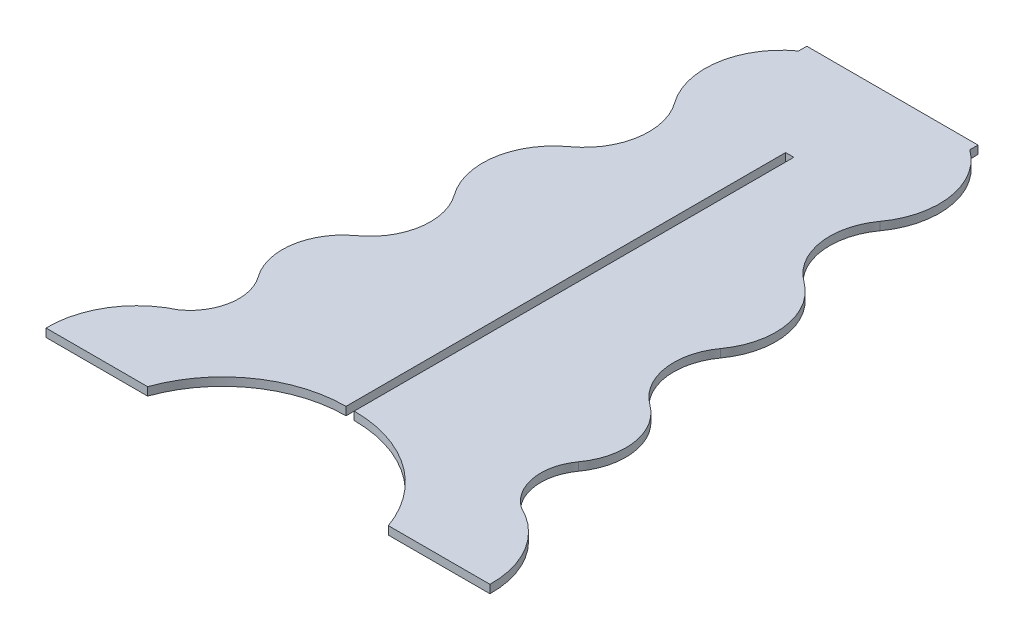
ISO-10303-21;
HEADER;
FILE_DESCRIPTION(('STEP AP214'),'2;1');
FILE_NAME('part.step','',(''),(''),'','','');
FILE_SCHEMA(('AUTOMOTIVE_DESIGN { 1 0 10303 214 1 1 1 1 }'));
ENDSEC;
DATA;
#1=APPLICATION_CONTEXT('core data for automotive mechanical design processes');
#2=APPLICATION_PROTOCOL_DEFINITION('international standard','automotive_design',2000,#1);
#3=PRODUCT_CONTEXT('',#1,'mechanical');
#4=PRODUCT('Part','Part','',(#3));
#5=PRODUCT_RELATED_PRODUCT_CATEGORY('part','',(#4));
#6=PRODUCT_DEFINITION_FORMATION('','',#4);
#7=PRODUCT_DEFINITION_CONTEXT('part definition',#1,'design');
#8=PRODUCT_DEFINITION('design','',#6,#7);
#9=PRODUCT_DEFINITION_SHAPE('','',#8);
#10=(LENGTH_UNIT() NAMED_UNIT(*) SI_UNIT(.MILLI.,.METRE.));
#11=(NAMED_UNIT(*) PLANE_ANGLE_UNIT() SI_UNIT($,.RADIAN.));
#12=(NAMED_UNIT(*) SI_UNIT($,.STERADIAN.) SOLID_ANGLE_UNIT());
#13=UNCERTAINTY_MEASURE_WITH_UNIT(LENGTH_MEASURE(1.E-05),#10,'distance_accuracy_value','');
#14=(GEOMETRIC_REPRESENTATION_CONTEXT(3) GLOBAL_UNCERTAINTY_ASSIGNED_CONTEXT((#13)) GLOBAL_UNIT_ASSIGNED_CONTEXT((#10,
#11,#12)) REPRESENTATION_CONTEXT('',''));
#15=CARTESIAN_POINT('',(0.,0.,0.));
#16=DIRECTION('',(0.,0.,1.));
#17=DIRECTION('',(1.,0.,0.));
#18=AXIS2_PLACEMENT_3D('',#15,#16,#17);
#19=CARTESIAN_POINT('',(193.997589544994,12.,117.55850333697));
#20=DIRECTION('',(0.,-1.,0.));
#21=DIRECTION('',(0.,0.,-1.));
#22=AXIS2_PLACEMENT_3D('',#19,#20,#21);
#23=CYLINDRICAL_SURFACE('',#22,130.21624969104);
#24=CARTESIAN_POINT('',(193.997589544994,0.,117.55850333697));
#25=DIRECTION('',(0.,1.,0.));
#26=DIRECTION('',(0.,0.,-1.));
#27=AXIS2_PLACEMENT_3D('',#24,#25,#26);
#28=CIRCLE('',#27,130.21624969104);
#29=CARTESIAN_POINT('',(324.190948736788,0.,120.));
#30=VERTEX_POINT('',#29);
#31=CARTESIAN_POINT('',(250.,0.,0.));
#32=VERTEX_POINT('',#31);
#33=EDGE_CURVE('E225',#30,#32,#28,.T.);
#34=ORIENTED_EDGE('',*,*,#33,.T.);
#35=DIRECTION('',(0.,-1.,0.));
#36=VECTOR('',#35,1.);
#37=CARTESIAN_POINT('',(250.,12.,0.));
#38=LINE('',#37,#36);
#39=CARTESIAN_POINT('',(250.,12.,0.));
#40=VERTEX_POINT('',#39);
#41=EDGE_CURVE('E11',#40,#32,#38,.T.);
#42=ORIENTED_EDGE('',*,*,#41,.F.);
#43=CARTESIAN_POINT('',(193.997589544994,12.,117.55850333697));
#44=DIRECTION('',(0.,1.,0.));
#45=DIRECTION('',(0.,0.,-1.));
#46=AXIS2_PLACEMENT_3D('',#43,#44,#45);
#47=CIRCLE('',#46,130.21624969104);
#48=CARTESIAN_POINT('',(324.190948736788,12.,120.));
#49=VERTEX_POINT('',#48);
#50=EDGE_CURVE('E271',#49,#40,#47,.T.);
#51=ORIENTED_EDGE('',*,*,#50,.F.);
#52=DIRECTION('',(0.,-1.,0.));
#53=VECTOR('',#52,1.);
#54=CARTESIAN_POINT('',(324.190948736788,12.,120.));
#55=LINE('',#54,#53);
#56=EDGE_CURVE('E221',#49,#30,#55,.T.);
#57=ORIENTED_EDGE('',*,*,#56,.T.);
#58=EDGE_LOOP('',(#34,#42,#51,#57));
#59=FACE_BOUND('',#58,.T.);
#60=ADVANCED_FACE('F33',(#59),#23,.T.);
#61=CARTESIAN_POINT('',(291.917635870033,12.,-57.9167335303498));
#62=DIRECTION('',(0.,-1.,0.));
#63=DIRECTION('',(0.,0.,-1.));
#64=AXIS2_PLACEMENT_3D('',#61,#62,#63);
#65=CYLINDRICAL_SURFACE('',#64,71.4943090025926);
#66=CARTESIAN_POINT('',(291.917635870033,0.,-57.9167335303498));
#67=DIRECTION('',(0.,-1.,0.));
#68=DIRECTION('',(0.,0.,1.));
#69=AXIS2_PLACEMENT_3D('',#66,#67,#68);
#70=CIRCLE('',#69,71.4943090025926);
#71=CARTESIAN_POINT('',(234.000902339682,0.,-99.8343694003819));
#72=VERTEX_POINT('',#71);
#73=EDGE_CURVE('E228',#32,#72,#70,.T.);
#74=ORIENTED_EDGE('',*,*,#73,.T.);
#75=DIRECTION('',(0.,-1.,0.));
#76=VECTOR('',#75,1.);
#77=CARTESIAN_POINT('',(234.000902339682,12.,-99.8343694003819));
#78=LINE('',#77,#76);
#79=CARTESIAN_POINT('',(234.000902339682,12.,-99.8343694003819));
#80=VERTEX_POINT('',#79);
#81=EDGE_CURVE('E41',#80,#72,#78,.T.);
#82=ORIENTED_EDGE('',*,*,#81,.F.);
#83=CARTESIAN_POINT('',(291.917635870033,12.,-57.9167335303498));
#84=DIRECTION('',(0.,-1.,0.));
#85=DIRECTION('',(0.,0.,1.));
#86=AXIS2_PLACEMENT_3D('',#83,#84,#85);
#87=CIRCLE('',#86,71.4943090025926);
#88=EDGE_CURVE('E140',#40,#80,#87,.T.);
#89=ORIENTED_EDGE('',*,*,#88,.F.);
#90=ORIENTED_EDGE('',*,*,#41,.T.);
#91=EDGE_LOOP('',(#74,#82,#89,#90));
#92=FACE_BOUND('',#91,.T.);
#93=ADVANCED_FACE('F409',(#92),#65,.F.);
#94=CARTESIAN_POINT('',(162.178085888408,12.,-151.816628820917));
#95=DIRECTION('',(0.,-1.,0.));
#96=DIRECTION('',(0.,0.,-1.));
#97=AXIS2_PLACEMENT_3D('',#94,#95,#96);
#98=CYLINDRICAL_SURFACE('',#97,88.6604323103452);
#99=CARTESIAN_POINT('',(162.178085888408,0.,-151.816628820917));
#100=DIRECTION('',(0.,1.,0.));
#101=DIRECTION('',(0.,0.,-1.));
#102=AXIS2_PLACEMENT_3D('',#99,#100,#101);
#103=CIRCLE('',#102,88.6604323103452);
#104=CARTESIAN_POINT('',(214.160345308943,0.,-223.639445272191));
#105=VERTEX_POINT('',#104);
#106=EDGE_CURVE('E230',#72,#105,#103,.T.);
#107=ORIENTED_EDGE('',*,*,#106,.T.);
#108=DIRECTION('',(0.,-1.,0.));
#109=VECTOR('',#108,1.);
#110=CARTESIAN_POINT('',(214.160345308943,12.,-223.639445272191));
#111=LINE('',#110,#109);
#112=CARTESIAN_POINT('',(214.160345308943,12.,-223.639445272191));
#113=VERTEX_POINT('',#112);
#114=EDGE_CURVE('E326',#113,#105,#111,.T.);
#115=ORIENTED_EDGE('',*,*,#114,.F.);
#116=CARTESIAN_POINT('',(162.178085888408,12.,-151.816628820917));
#117=DIRECTION('',(0.,1.,0.));
#118=DIRECTION('',(0.,0.,-1.));
#119=AXIS2_PLACEMENT_3D('',#116,#117,#118);
#120=CIRCLE('',#119,88.6604323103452);
#121=EDGE_CURVE('E334',#80,#113,#120,.T.);
#122=ORIENTED_EDGE('',*,*,#121,.F.);
#123=ORIENTED_EDGE('',*,*,#81,.T.);
#124=EDGE_LOOP('',(#107,#115,#122,#123));
#125=FACE_BOUND('',#124,.T.);
#126=ADVANCED_FACE('F332',(#125),#98,.T.);
#127=CARTESIAN_POINT('',(265.82579663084,12.,-295.024534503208));
#128=DIRECTION('',(0.,-1.,0.));
#129=DIRECTION('',(0.,0.,-1.));
#130=AXIS2_PLACEMENT_3D('',#127,#128,#129);
#131=CYLINDRICAL_SURFACE('',#130,88.1200875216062);
#132=CARTESIAN_POINT('',(265.82579663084,0.,-295.024534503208));
#133=DIRECTION('',(0.,-1.,0.));
#134=DIRECTION('',(0.,0.,1.));
#135=AXIS2_PLACEMENT_3D('',#132,#133,#134);
#136=CIRCLE('',#135,88.1200875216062);
#137=CARTESIAN_POINT('',(194.440707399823,0.,-346.689985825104));
#138=VERTEX_POINT('',#137);
#139=EDGE_CURVE('E232',#105,#138,#136,.T.);
#140=ORIENTED_EDGE('',*,*,#139,.T.);
#141=DIRECTION('',(0.,-1.,0.));
#142=VECTOR('',#141,1.);
#143=CARTESIAN_POINT('',(194.440707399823,12.,-346.689985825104));
#144=LINE('',#143,#142);
#145=CARTESIAN_POINT('',(194.440707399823,12.,-346.689985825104));
#146=VERTEX_POINT('',#145);
#147=EDGE_CURVE('E323',#146,#138,#144,.T.);
#148=ORIENTED_EDGE('',*,*,#147,.F.);
#149=CARTESIAN_POINT('',(265.82579663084,12.,-295.024534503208));
#150=DIRECTION('',(0.,-1.,0.));
#151=DIRECTION('',(0.,0.,1.));
#152=AXIS2_PLACEMENT_3D('',#149,#150,#151);
#153=CIRCLE('',#152,88.1200875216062);
#154=EDGE_CURVE('E352',#113,#146,#153,.T.);
#155=ORIENTED_EDGE('',*,*,#154,.F.);
#156=ORIENTED_EDGE('',*,*,#114,.T.);
#157=EDGE_LOOP('',(#140,#148,#155,#156));
#158=FACE_BOUND('',#157,.T.);
#159=ADVANCED_FACE('F343',(#158),#131,.F.);
#160=CARTESIAN_POINT('',(110.324289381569,12.,-407.569824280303));
#161=DIRECTION('',(0.,-1.,0.));
#162=DIRECTION('',(0.,0.,-1.));
#163=AXIS2_PLACEMENT_3D('',#160,#161,#162);
#164=CYLINDRICAL_SURFACE('',#163,103.836055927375);
#165=CARTESIAN_POINT('',(110.324289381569,0.,-407.569824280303));
#166=DIRECTION('',(0.,1.,0.));
#167=DIRECTION('',(0.,0.,-1.));
#168=AXIS2_PLACEMENT_3D('',#165,#166,#167);
#169=CIRCLE('',#168,103.836055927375);
#170=CARTESIAN_POINT('',(171.20412783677,0.,-491.686242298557));
#171=VERTEX_POINT('',#170);
#172=EDGE_CURVE('E234',#138,#171,#169,.T.);
#173=ORIENTED_EDGE('',*,*,#172,.T.);
#174=DIRECTION('',(0.,-1.,0.));
#175=VECTOR('',#174,1.);
#176=CARTESIAN_POINT('',(171.20412783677,12.,-491.686242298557));
#177=LINE('',#176,#175);
#178=CARTESIAN_POINT('',(171.20412783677,12.,-491.686242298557));
#179=VERTEX_POINT('',#178);
#180=EDGE_CURVE('E320',#179,#171,#177,.T.);
#181=ORIENTED_EDGE('',*,*,#180,.F.);
#182=CARTESIAN_POINT('',(110.324289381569,12.,-407.569824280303));
#183=DIRECTION('',(0.,1.,0.));
#184=DIRECTION('',(0.,0.,-1.));
#185=AXIS2_PLACEMENT_3D('',#182,#183,#184);
#186=CIRCLE('',#185,103.836055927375);
#187=EDGE_CURVE('E349',#146,#179,#186,.T.);
#188=ORIENTED_EDGE('',*,*,#187,.F.);
#189=ORIENTED_EDGE('',*,*,#147,.T.);
#190=EDGE_LOOP('',(#173,#181,#188,#189));
#191=FACE_BOUND('',#190,.T.);
#192=ADVANCED_FACE('F347',(#191),#164,.T.);
#193=CARTESIAN_POINT('',(226.775992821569,12.,-568.468742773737));
#194=DIRECTION('',(0.,-1.,0.));
#195=DIRECTION('',(0.,0.,-1.));
#196=AXIS2_PLACEMENT_3D('',#193,#194,#195);
#197=CYLINDRICAL_SURFACE('',#196,94.7828283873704);
#198=CARTESIAN_POINT('',(226.775992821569,0.,-568.468742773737));
#199=DIRECTION('',(0.,-1.,0.));
#200=DIRECTION('',(0.,0.,1.));
#201=AXIS2_PLACEMENT_3D('',#198,#199,#200);
#202=CIRCLE('',#201,94.7828283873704);
#203=CARTESIAN_POINT('',(149.993492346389,0.,-624.040607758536));
#204=VERTEX_POINT('',#203);
#205=EDGE_CURVE('E236',#171,#204,#202,.T.);
#206=ORIENTED_EDGE('',*,*,#205,.T.);
#207=DIRECTION('',(0.,-1.,0.));
#208=VECTOR('',#207,1.);
#209=CARTESIAN_POINT('',(149.993492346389,12.,-624.040607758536));
#210=LINE('',#209,#208);
#211=CARTESIAN_POINT('',(149.993492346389,12.,-624.040607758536));
#212=VERTEX_POINT('',#211);
#213=EDGE_CURVE('E317',#212,#204,#210,.T.);
#214=ORIENTED_EDGE('',*,*,#213,.F.);
#215=CARTESIAN_POINT('',(226.775992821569,12.,-568.468742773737));
#216=DIRECTION('',(0.,-1.,0.));
#217=DIRECTION('',(0.,0.,1.));
#218=AXIS2_PLACEMENT_3D('',#215,#216,#217);
#219=CIRCLE('',#218,94.7828283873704);
#220=EDGE_CURVE('E351',#179,#212,#219,.T.);
#221=ORIENTED_EDGE('',*,*,#220,.F.);
#222=ORIENTED_EDGE('',*,*,#180,.T.);
#223=EDGE_LOOP('',(#206,#214,#221,#222));
#224=FACE_BOUND('',#223,.T.);
#225=ADVANCED_FACE('F422',(#224),#197,.F.);
#226=CARTESIAN_POINT('',(59.5170500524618,12.,-689.523557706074));
#227=DIRECTION('',(0.,-1.,0.));
#228=DIRECTION('',(0.,0.,-1.));
#229=AXIS2_PLACEMENT_3D('',#226,#227,#228);
#230=CYLINDRICAL_SURFACE('',#229,111.687077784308);
#231=CARTESIAN_POINT('',(59.5170500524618,0.,-689.523557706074));
#232=DIRECTION('',(0.,1.,0.));
#233=DIRECTION('',(0.,0.,-1.));
#234=AXIS2_PLACEMENT_3D('',#231,#232,#233);
#235=CIRCLE('',#234,111.687077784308);
#236=CARTESIAN_POINT('',(125.,0.,-780.));
#237=VERTEX_POINT('',#236);
#238=EDGE_CURVE('E238',#204,#237,#235,.T.);
#239=ORIENTED_EDGE('',*,*,#238,.T.);
#240=DIRECTION('',(0.,-1.,0.));
#241=VECTOR('',#240,1.);
#242=CARTESIAN_POINT('',(125.,12.,-780.));
#243=LINE('',#242,#241);
#244=CARTESIAN_POINT('',(125.,12.,-780.));
#245=VERTEX_POINT('',#244);
#246=EDGE_CURVE('E314',#245,#237,#243,.T.);
#247=ORIENTED_EDGE('',*,*,#246,.F.);
#248=CARTESIAN_POINT('',(59.5170500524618,12.,-689.523557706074));
#249=DIRECTION('',(0.,1.,0.));
#250=DIRECTION('',(0.,0.,-1.));
#251=AXIS2_PLACEMENT_3D('',#248,#249,#250);
#252=CIRCLE('',#251,111.687077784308);
#253=EDGE_CURVE('E354',#212,#245,#252,.T.);
#254=ORIENTED_EDGE('',*,*,#253,.F.);
#255=ORIENTED_EDGE('',*,*,#213,.T.);
#256=EDGE_LOOP('',(#239,#247,#254,#255));
#257=FACE_BOUND('',#256,.T.);
#258=ADVANCED_FACE('F425',(#257),#230,.T.);
#259=CARTESIAN_POINT('',(125.,12.,-780.));
#260=DIRECTION('',(-1.,0.,0.));
#261=DIRECTION('',(0.,0.,1.));
#262=AXIS2_PLACEMENT_3D('',#259,#260,#261);
#263=PLANE('',#262);
#264=DIRECTION('',(0.,0.,-1.));
#265=VECTOR('',#264,1.);
#266=CARTESIAN_POINT('',(125.,0.,-780.));
#267=LINE('',#266,#265);
#268=CARTESIAN_POINT('',(125.,0.,-792.));
#269=VERTEX_POINT('',#268);
#270=EDGE_CURVE('E240',#237,#269,#267,.T.);
#271=ORIENTED_EDGE('',*,*,#270,.T.);
#272=DIRECTION('',(0.,-1.,0.));
#273=VECTOR('',#272,1.);
#274=CARTESIAN_POINT('',(125.,12.,-792.));
#275=LINE('',#274,#273);
#276=CARTESIAN_POINT('',(125.,12.,-792.));
#277=VERTEX_POINT('',#276);
#278=EDGE_CURVE('E311',#277,#269,#275,.T.);
#279=ORIENTED_EDGE('',*,*,#278,.F.);
#280=DIRECTION('',(0.,0.,-1.));
#281=VECTOR('',#280,1.);
#282=CARTESIAN_POINT('',(125.,12.,-780.));
#283=LINE('',#282,#281);
#284=EDGE_CURVE('E360',#245,#277,#283,.T.);
#285=ORIENTED_EDGE('',*,*,#284,.F.);
#286=ORIENTED_EDGE('',*,*,#246,.T.);
#287=EDGE_LOOP('',(#271,#279,#285,#286));
#288=FACE_BOUND('',#287,.T.);
#289=ADVANCED_FACE('F429',(#288),#263,.F.);
#290=CARTESIAN_POINT('',(125.,12.,-792.));
#291=DIRECTION('',(0.,0.,1.));
#292=DIRECTION('',(1.,0.,0.));
#293=AXIS2_PLACEMENT_3D('',#290,#291,#292);
#294=PLANE('',#293);
#295=DIRECTION('',(-1.,0.,0.));
#296=VECTOR('',#295,1.);
#297=CARTESIAN_POINT('',(125.,0.,-792.));
#298=LINE('',#297,#296);
#299=CARTESIAN_POINT('',(-125.,0.,-792.));
#300=VERTEX_POINT('',#299);
#301=EDGE_CURVE('E242',#269,#300,#298,.T.);
#302=ORIENTED_EDGE('',*,*,#301,.T.);
#303=DIRECTION('',(0.,-1.,0.));
#304=VECTOR('',#303,1.);
#305=CARTESIAN_POINT('',(-125.,12.,-792.));
#306=LINE('',#305,#304);
#307=CARTESIAN_POINT('',(-125.,12.,-792.));
#308=VERTEX_POINT('',#307);
#309=EDGE_CURVE('E308',#308,#300,#306,.T.);
#310=ORIENTED_EDGE('',*,*,#309,.F.);
#311=DIRECTION('',(-1.,0.,0.));
#312=VECTOR('',#311,1.);
#313=CARTESIAN_POINT('',(125.,12.,-792.));
#314=LINE('',#313,#312);
#315=EDGE_CURVE('E362',#277,#308,#314,.T.);
#316=ORIENTED_EDGE('',*,*,#315,.F.);
#317=ORIENTED_EDGE('',*,*,#278,.T.);
#318=EDGE_LOOP('',(#302,#310,#316,#317));
#319=FACE_BOUND('',#318,.T.);
#320=ADVANCED_FACE('F433',(#319),#294,.F.);
#321=CARTESIAN_POINT('',(-125.,12.,-780.));
#322=DIRECTION('',(1.,0.,0.));
#323=DIRECTION('',(0.,0.,-1.));
#324=AXIS2_PLACEMENT_3D('',#321,#322,#323);
#325=PLANE('',#324);
#326=DIRECTION('',(0.,0.,1.));
#327=VECTOR('',#326,1.);
#328=CARTESIAN_POINT('',(-125.,0.,-780.));
#329=LINE('',#328,#327);
#330=CARTESIAN_POINT('',(-125.,0.,-780.));
#331=VERTEX_POINT('',#330);
#332=EDGE_CURVE('E244',#300,#331,#329,.T.);
#333=ORIENTED_EDGE('',*,*,#332,.T.);
#334=DIRECTION('',(0.,-1.,0.));
#335=VECTOR('',#334,1.);
#336=CARTESIAN_POINT('',(-125.,12.,-780.));
#337=LINE('',#336,#335);
#338=CARTESIAN_POINT('',(-125.,12.,-780.));
#339=VERTEX_POINT('',#338);
#340=EDGE_CURVE('E305',#339,#331,#337,.T.);
#341=ORIENTED_EDGE('',*,*,#340,.F.);
#342=DIRECTION('',(0.,0.,1.));
#343=VECTOR('',#342,1.);
#344=CARTESIAN_POINT('',(-125.,12.,-780.));
#345=LINE('',#344,#343);
#346=EDGE_CURVE('E364',#308,#339,#345,.T.);
#347=ORIENTED_EDGE('',*,*,#346,.F.);
#348=ORIENTED_EDGE('',*,*,#309,.T.);
#349=EDGE_LOOP('',(#333,#341,#347,#348));
#350=FACE_BOUND('',#349,.T.);
#351=ADVANCED_FACE('F437',(#350),#325,.F.);
#352=CARTESIAN_POINT('',(-59.5170500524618,12.,-689.523557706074));
#353=DIRECTION('',(0.,-1.,0.));
#354=DIRECTION('',(0.,0.,-1.));
#355=AXIS2_PLACEMENT_3D('',#352,#353,#354);
#356=CYLINDRICAL_SURFACE('',#355,111.687077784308);
#357=CARTESIAN_POINT('',(-59.5170500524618,0.,-689.523557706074));
#358=DIRECTION('',(0.,1.,0.));
#359=DIRECTION('',(0.,0.,1.));
#360=AXIS2_PLACEMENT_3D('',#357,#358,#359);
#361=CIRCLE('',#360,111.687077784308);
#362=CARTESIAN_POINT('',(-149.993492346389,0.,-624.040607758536));
#363=VERTEX_POINT('',#362);
#364=EDGE_CURVE('E246',#331,#363,#361,.T.);
#365=ORIENTED_EDGE('',*,*,#364,.T.);
#366=DIRECTION('',(0.,-1.,0.));
#367=VECTOR('',#366,1.);
#368=CARTESIAN_POINT('',(-149.993492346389,12.,-624.040607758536));
#369=LINE('',#368,#367);
#370=CARTESIAN_POINT('',(-149.993492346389,12.,-624.040607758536));
#371=VERTEX_POINT('',#370);
#372=EDGE_CURVE('E302',#371,#363,#369,.T.);
#373=ORIENTED_EDGE('',*,*,#372,.F.);
#374=CARTESIAN_POINT('',(-59.5170500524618,12.,-689.523557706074));
#375=DIRECTION('',(0.,1.,0.));
#376=DIRECTION('',(0.,0.,1.));
#377=AXIS2_PLACEMENT_3D('',#374,#375,#376);
#378=CIRCLE('',#377,111.687077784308);
#379=EDGE_CURVE('E366',#339,#371,#378,.T.);
#380=ORIENTED_EDGE('',*,*,#379,.F.);
#381=ORIENTED_EDGE('',*,*,#340,.T.);
#382=EDGE_LOOP('',(#365,#373,#380,#381));
#383=FACE_BOUND('',#382,.T.);
#384=ADVANCED_FACE('F441',(#383),#356,.T.);
#385=CARTESIAN_POINT('',(-226.775992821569,12.,-568.468742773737));
#386=DIRECTION('',(0.,-1.,0.));
#387=DIRECTION('',(0.,0.,-1.));
#388=AXIS2_PLACEMENT_3D('',#385,#386,#387);
#389=CYLINDRICAL_SURFACE('',#388,94.7828283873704);
#390=CARTESIAN_POINT('',(-226.775992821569,0.,-568.468742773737));
#391=DIRECTION('',(0.,-1.,0.));
#392=DIRECTION('',(0.,0.,-1.));
#393=AXIS2_PLACEMENT_3D('',#390,#391,#392);
#394=CIRCLE('',#393,94.7828283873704);
#395=CARTESIAN_POINT('',(-171.20412783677,0.,-491.686242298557));
#396=VERTEX_POINT('',#395);
#397=EDGE_CURVE('E248',#363,#396,#394,.T.);
#398=ORIENTED_EDGE('',*,*,#397,.T.);
#399=DIRECTION('',(0.,-1.,0.));
#400=VECTOR('',#399,1.);
#401=CARTESIAN_POINT('',(-171.20412783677,12.,-491.686242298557));
#402=LINE('',#401,#400);
#403=CARTESIAN_POINT('',(-171.20412783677,12.,-491.686242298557));
#404=VERTEX_POINT('',#403);
#405=EDGE_CURVE('E299',#404,#396,#402,.T.);
#406=ORIENTED_EDGE('',*,*,#405,.F.);
#407=CARTESIAN_POINT('',(-226.775992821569,12.,-568.468742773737));
#408=DIRECTION('',(0.,-1.,0.));
#409=DIRECTION('',(0.,0.,-1.));
#410=AXIS2_PLACEMENT_3D('',#407,#408,#409);
#411=CIRCLE('',#410,94.7828283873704);
#412=EDGE_CURVE('E368',#371,#404,#411,.T.);
#413=ORIENTED_EDGE('',*,*,#412,.F.);
#414=ORIENTED_EDGE('',*,*,#372,.T.);
#415=EDGE_LOOP('',(#398,#406,#413,#414));
#416=FACE_BOUND('',#415,.T.);
#417=ADVANCED_FACE('F445',(#416),#389,.F.);
#418=CARTESIAN_POINT('',(-110.324289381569,12.,-407.569824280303));
#419=DIRECTION('',(0.,-1.,0.));
#420=DIRECTION('',(0.,0.,-1.));
#421=AXIS2_PLACEMENT_3D('',#418,#419,#420);
#422=CYLINDRICAL_SURFACE('',#421,103.836055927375);
#423=CARTESIAN_POINT('',(-110.324289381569,0.,-407.569824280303));
#424=DIRECTION('',(0.,1.,0.));
#425=DIRECTION('',(0.,0.,1.));
#426=AXIS2_PLACEMENT_3D('',#423,#424,#425);
#427=CIRCLE('',#426,103.836055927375);
#428=CARTESIAN_POINT('',(-194.440707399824,0.,-346.689985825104));
#429=VERTEX_POINT('',#428);
#430=EDGE_CURVE('E250',#396,#429,#427,.T.);
#431=ORIENTED_EDGE('',*,*,#430,.T.);
#432=DIRECTION('',(0.,-1.,0.));
#433=VECTOR('',#432,1.);
#434=CARTESIAN_POINT('',(-194.440707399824,12.,-346.689985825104));
#435=LINE('',#434,#433);
#436=CARTESIAN_POINT('',(-194.440707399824,12.,-346.689985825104));
#437=VERTEX_POINT('',#436);
#438=EDGE_CURVE('E296',#437,#429,#435,.T.);
#439=ORIENTED_EDGE('',*,*,#438,.F.);
#440=CARTESIAN_POINT('',(-110.324289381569,12.,-407.569824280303));
#441=DIRECTION('',(0.,1.,0.));
#442=DIRECTION('',(0.,0.,1.));
#443=AXIS2_PLACEMENT_3D('',#440,#441,#442);
#444=CIRCLE('',#443,103.836055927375);
#445=EDGE_CURVE('E370',#404,#437,#444,.T.);
#446=ORIENTED_EDGE('',*,*,#445,.F.);
#447=ORIENTED_EDGE('',*,*,#405,.T.);
#448=EDGE_LOOP('',(#431,#439,#446,#447));
#449=FACE_BOUND('',#448,.T.);
#450=ADVANCED_FACE('F449',(#449),#422,.T.);
#451=CARTESIAN_POINT('',(-265.82579663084,12.,-295.024534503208));
#452=DIRECTION('',(0.,-1.,0.));
#453=DIRECTION('',(0.,0.,-1.));
#454=AXIS2_PLACEMENT_3D('',#451,#452,#453);
#455=CYLINDRICAL_SURFACE('',#454,88.1200875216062);
#456=CARTESIAN_POINT('',(-265.82579663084,0.,-295.024534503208));
#457=DIRECTION('',(0.,-1.,0.));
#458=DIRECTION('',(0.,0.,-1.));
#459=AXIS2_PLACEMENT_3D('',#456,#457,#458);
#460=CIRCLE('',#459,88.1200875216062);
#461=CARTESIAN_POINT('',(-214.160345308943,0.,-223.639445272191));
#462=VERTEX_POINT('',#461);
#463=EDGE_CURVE('E252',#429,#462,#460,.T.);
#464=ORIENTED_EDGE('',*,*,#463,.T.);
#465=DIRECTION('',(0.,-1.,0.));
#466=VECTOR('',#465,1.);
#467=CARTESIAN_POINT('',(-214.160345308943,12.,-223.639445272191));
#468=LINE('',#467,#466);
#469=CARTESIAN_POINT('',(-214.160345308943,12.,-223.639445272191));
#470=VERTEX_POINT('',#469);
#471=EDGE_CURVE('E293',#470,#462,#468,.T.);
#472=ORIENTED_EDGE('',*,*,#471,.F.);
#473=CARTESIAN_POINT('',(-265.82579663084,12.,-295.024534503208));
#474=DIRECTION('',(0.,-1.,0.));
#475=DIRECTION('',(0.,0.,-1.));
#476=AXIS2_PLACEMENT_3D('',#473,#474,#475);
#477=CIRCLE('',#476,88.1200875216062);
#478=EDGE_CURVE('E372',#437,#470,#477,.T.);
#479=ORIENTED_EDGE('',*,*,#478,.F.);
#480=ORIENTED_EDGE('',*,*,#438,.T.);
#481=EDGE_LOOP('',(#464,#472,#479,#480));
#482=FACE_BOUND('',#481,.T.);
#483=ADVANCED_FACE('F453',(#482),#455,.F.);
#484=CARTESIAN_POINT('',(-162.178085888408,12.,-151.816628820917));
#485=DIRECTION('',(0.,-1.,0.));
#486=DIRECTION('',(0.,0.,-1.));
#487=AXIS2_PLACEMENT_3D('',#484,#485,#486);
#488=CYLINDRICAL_SURFACE('',#487,88.6604323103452);
#489=CARTESIAN_POINT('',(-162.178085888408,0.,-151.816628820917));
#490=DIRECTION('',(0.,1.,0.));
#491=DIRECTION('',(0.,0.,1.));
#492=AXIS2_PLACEMENT_3D('',#489,#490,#491);
#493=CIRCLE('',#492,88.6604323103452);
#494=CARTESIAN_POINT('',(-234.000902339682,0.,-99.8343694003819));
#495=VERTEX_POINT('',#494);
#496=EDGE_CURVE('E254',#462,#495,#493,.T.);
#497=ORIENTED_EDGE('',*,*,#496,.T.);
#498=DIRECTION('',(0.,-1.,0.));
#499=VECTOR('',#498,1.);
#500=CARTESIAN_POINT('',(-234.000902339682,12.,-99.8343694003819));
#501=LINE('',#500,#499);
#502=CARTESIAN_POINT('',(-234.000902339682,12.,-99.8343694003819));
#503=VERTEX_POINT('',#502);
#504=EDGE_CURVE('E290',#503,#495,#501,.T.);
#505=ORIENTED_EDGE('',*,*,#504,.F.);
#506=CARTESIAN_POINT('',(-162.178085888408,12.,-151.816628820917));
#507=DIRECTION('',(0.,1.,0.));
#508=DIRECTION('',(0.,0.,1.));
#509=AXIS2_PLACEMENT_3D('',#506,#507,#508);
#510=CIRCLE('',#509,88.6604323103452);
#511=EDGE_CURVE('E374',#470,#503,#510,.T.);
#512=ORIENTED_EDGE('',*,*,#511,.F.);
#513=ORIENTED_EDGE('',*,*,#471,.T.);
#514=EDGE_LOOP('',(#497,#505,#512,#513));
#515=FACE_BOUND('',#514,.T.);
#516=ADVANCED_FACE('F457',(#515),#488,.T.);
#517=CARTESIAN_POINT('',(-291.917635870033,12.,-57.9167335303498));
#518=DIRECTION('',(0.,-1.,0.));
#519=DIRECTION('',(0.,0.,-1.));
#520=AXIS2_PLACEMENT_3D('',#517,#518,#519);
#521=CYLINDRICAL_SURFACE('',#520,71.4943090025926);
#522=CARTESIAN_POINT('',(-291.917635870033,0.,-57.9167335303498));
#523=DIRECTION('',(0.,-1.,0.));
#524=DIRECTION('',(0.,0.,-1.));
#525=AXIS2_PLACEMENT_3D('',#522,#523,#524);
#526=CIRCLE('',#525,71.4943090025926);
#527=CARTESIAN_POINT('',(-250.,0.,0.));
#528=VERTEX_POINT('',#527);
#529=EDGE_CURVE('E256',#495,#528,#526,.T.);
#530=ORIENTED_EDGE('',*,*,#529,.T.);
#531=DIRECTION('',(0.,-1.,0.));
#532=VECTOR('',#531,1.);
#533=CARTESIAN_POINT('',(-250.,12.,0.));
#534=LINE('',#533,#532);
#535=CARTESIAN_POINT('',(-250.,12.,0.));
#536=VERTEX_POINT('',#535);
#537=EDGE_CURVE('E287',#536,#528,#534,.T.);
#538=ORIENTED_EDGE('',*,*,#537,.F.);
#539=CARTESIAN_POINT('',(-291.917635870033,12.,-57.9167335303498));
#540=DIRECTION('',(0.,-1.,0.));
#541=DIRECTION('',(0.,0.,-1.));
#542=AXIS2_PLACEMENT_3D('',#539,#540,#541);
#543=CIRCLE('',#542,71.4943090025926);
#544=EDGE_CURVE('E376',#503,#536,#543,.T.);
#545=ORIENTED_EDGE('',*,*,#544,.F.);
#546=ORIENTED_EDGE('',*,*,#504,.T.);
#547=EDGE_LOOP('',(#530,#538,#545,#546));
#548=FACE_BOUND('',#547,.T.);
#549=ADVANCED_FACE('F461',(#548),#521,.F.);
#550=CARTESIAN_POINT('',(-193.997589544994,12.,117.55850333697));
#551=DIRECTION('',(0.,-1.,0.));
#552=DIRECTION('',(0.,0.,-1.));
#553=AXIS2_PLACEMENT_3D('',#550,#551,#552);
#554=CYLINDRICAL_SURFACE('',#553,130.21624969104);
#555=CARTESIAN_POINT('',(-193.997589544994,0.,117.55850333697));
#556=DIRECTION('',(0.,1.,0.));
#557=DIRECTION('',(0.,0.,1.));
#558=AXIS2_PLACEMENT_3D('',#555,#556,#557);
#559=CIRCLE('',#558,130.21624969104);
#560=CARTESIAN_POINT('',(-324.190948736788,0.,120.));
#561=VERTEX_POINT('',#560);
#562=EDGE_CURVE('E258',#528,#561,#559,.T.);
#563=ORIENTED_EDGE('',*,*,#562,.T.);
#564=DIRECTION('',(0.,-1.,0.));
#565=VECTOR('',#564,1.);
#566=CARTESIAN_POINT('',(-324.190948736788,12.,120.));
#567=LINE('',#566,#565);
#568=CARTESIAN_POINT('',(-324.190948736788,12.,120.));
#569=VERTEX_POINT('',#568);
#570=EDGE_CURVE('E284',#569,#561,#567,.T.);
#571=ORIENTED_EDGE('',*,*,#570,.F.);
#572=CARTESIAN_POINT('',(-193.997589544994,12.,117.55850333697));
#573=DIRECTION('',(0.,1.,0.));
#574=DIRECTION('',(0.,0.,1.));
#575=AXIS2_PLACEMENT_3D('',#572,#573,#574);
#576=CIRCLE('',#575,130.21624969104);
#577=EDGE_CURVE('E378',#536,#569,#576,.T.);
#578=ORIENTED_EDGE('',*,*,#577,.F.);
#579=ORIENTED_EDGE('',*,*,#537,.T.);
#580=EDGE_LOOP('',(#563,#571,#578,#579));
#581=FACE_BOUND('',#580,.T.);
#582=ADVANCED_FACE('F465',(#581),#554,.T.);
#583=CARTESIAN_POINT('',(-324.190948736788,12.,120.));
#584=DIRECTION('',(0.,0.,-1.));
#585=DIRECTION('',(-1.,0.,0.));
#586=AXIS2_PLACEMENT_3D('',#583,#584,#585);
#587=PLANE('',#586);
#588=DIRECTION('',(1.,0.,0.));
#589=VECTOR('',#588,1.);
#590=CARTESIAN_POINT('',(-324.190948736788,0.,120.));
#591=LINE('',#590,#589);
#592=CARTESIAN_POINT('',(-175.809051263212,0.,120.));
#593=VERTEX_POINT('',#592);
#594=EDGE_CURVE('E260',#561,#593,#591,.T.);
#595=ORIENTED_EDGE('',*,*,#594,.T.);
#596=DIRECTION('',(0.,-1.,0.));
#597=VECTOR('',#596,1.);
#598=CARTESIAN_POINT('',(-175.809051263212,12.,120.));
#599=LINE('',#598,#597);
#600=CARTESIAN_POINT('',(-175.809051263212,12.,120.));
#601=VERTEX_POINT('',#600);
#602=EDGE_CURVE('E281',#601,#593,#599,.T.);
#603=ORIENTED_EDGE('',*,*,#602,.F.);
#604=DIRECTION('',(1.,0.,0.));
#605=VECTOR('',#604,1.);
#606=CARTESIAN_POINT('',(-324.190948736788,12.,120.));
#607=LINE('',#606,#605);
#608=EDGE_CURVE('E380',#569,#601,#607,.T.);
#609=ORIENTED_EDGE('',*,*,#608,.F.);
#610=ORIENTED_EDGE('',*,*,#570,.T.);
#611=EDGE_LOOP('',(#595,#603,#609,#610));
#612=FACE_BOUND('',#611,.T.);
#613=ADVANCED_FACE('F469',(#612),#587,.F.);
#614=CARTESIAN_POINT('',(-5.99999999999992,12.,180.1463078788));
#615=DIRECTION('',(0.,-1.,0.));
#616=DIRECTION('',(0.,0.,-1.));
#617=AXIS2_PLACEMENT_3D('',#614,#615,#616);
#618=CYLINDRICAL_SURFACE('',#617,180.1463078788);
#619=CARTESIAN_POINT('',(-5.99999999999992,0.,180.1463078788));
#620=DIRECTION('',(0.,-1.,0.));
#621=DIRECTION('',(0.,0.,-1.));
#622=AXIS2_PLACEMENT_3D('',#619,#620,#621);
#623=CIRCLE('',#622,180.1463078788);
#624=CARTESIAN_POINT('',(-5.99999999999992,0.,0.));
#625=VERTEX_POINT('',#624);
#626=EDGE_CURVE('E262',#593,#625,#623,.T.);
#627=ORIENTED_EDGE('',*,*,#626,.T.);
#628=DIRECTION('',(0.,-1.,0.));
#629=VECTOR('',#628,1.);
#630=CARTESIAN_POINT('',(-5.99999999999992,12.,0.));
#631=LINE('',#630,#629);
#632=CARTESIAN_POINT('',(-5.99999999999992,12.,0.));
#633=VERTEX_POINT('',#632);
#634=EDGE_CURVE('E278',#633,#625,#631,.T.);
#635=ORIENTED_EDGE('',*,*,#634,.F.);
#636=CARTESIAN_POINT('',(-5.99999999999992,12.,180.1463078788));
#637=DIRECTION('',(0.,-1.,0.));
#638=DIRECTION('',(0.,0.,-1.));
#639=AXIS2_PLACEMENT_3D('',#636,#637,#638);
#640=CIRCLE('',#639,180.1463078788);
#641=EDGE_CURVE('E382',#601,#633,#640,.T.);
#642=ORIENTED_EDGE('',*,*,#641,.F.);
#643=ORIENTED_EDGE('',*,*,#602,.T.);
#644=EDGE_LOOP('',(#627,#635,#642,#643));
#645=FACE_BOUND('',#644,.T.);
#646=ADVANCED_FACE('F473',(#645),#618,.F.);
#647=CARTESIAN_POINT('',(-6.,12.,0.));
#648=DIRECTION('',(-1.,0.,0.));
#649=DIRECTION('',(0.,0.,1.));
#650=AXIS2_PLACEMENT_3D('',#647,#648,#649);
#651=PLANE('',#650);
#652=DIRECTION('',(0.,0.,-1.));
#653=VECTOR('',#652,1.);
#654=CARTESIAN_POINT('',(-6.,0.,0.));
#655=LINE('',#654,#653);
#656=CARTESIAN_POINT('',(-6.,0.,-642.));
#657=VERTEX_POINT('',#656);
#658=EDGE_CURVE('E264',#625,#657,#655,.T.);
#659=ORIENTED_EDGE('',*,*,#658,.T.);
#660=DIRECTION('',(0.,-1.,0.));
#661=VECTOR('',#660,1.);
#662=CARTESIAN_POINT('',(-6.,12.,-642.));
#663=LINE('',#662,#661);
#664=CARTESIAN_POINT('',(-6.,12.,-642.));
#665=VERTEX_POINT('',#664);
#666=EDGE_CURVE('E275',#665,#657,#663,.T.);
#667=ORIENTED_EDGE('',*,*,#666,.F.);
#668=DIRECTION('',(0.,0.,-1.));
#669=VECTOR('',#668,1.);
#670=CARTESIAN_POINT('',(-6.,12.,0.));
#671=LINE('',#670,#669);
#672=EDGE_CURVE('E384',#633,#665,#671,.T.);
#673=ORIENTED_EDGE('',*,*,#672,.F.);
#674=ORIENTED_EDGE('',*,*,#634,.T.);
#675=EDGE_LOOP('',(#659,#667,#673,#674));
#676=FACE_BOUND('',#675,.T.);
#677=ADVANCED_FACE('F390',(#676),#651,.F.);
#678=CARTESIAN_POINT('',(6.,12.,-642.));
#679=DIRECTION('',(0.,0.,-1.));
#680=DIRECTION('',(-1.,0.,0.));
#681=AXIS2_PLACEMENT_3D('',#678,#679,#680);
#682=PLANE('',#681);
#683=DIRECTION('',(1.,0.,0.));
#684=VECTOR('',#683,1.);
#685=CARTESIAN_POINT('',(6.,0.,-642.));
#686=LINE('',#685,#684);
#687=CARTESIAN_POINT('',(6.,0.,-642.));
#688=VERTEX_POINT('',#687);
#689=EDGE_CURVE('E266',#657,#688,#686,.T.);
#690=ORIENTED_EDGE('',*,*,#689,.T.);
#691=DIRECTION('',(0.,-1.,0.));
#692=VECTOR('',#691,1.);
#693=CARTESIAN_POINT('',(6.,12.,-642.));
#694=LINE('',#693,#692);
#695=CARTESIAN_POINT('',(6.,12.,-642.));
#696=VERTEX_POINT('',#695);
#697=EDGE_CURVE('E216',#696,#688,#694,.T.);
#698=ORIENTED_EDGE('',*,*,#697,.F.);
#699=DIRECTION('',(1.,0.,0.));
#700=VECTOR('',#699,1.);
#701=CARTESIAN_POINT('',(6.,12.,-642.));
#702=LINE('',#701,#700);
#703=EDGE_CURVE('E207',#665,#696,#702,.T.);
#704=ORIENTED_EDGE('',*,*,#703,.F.);
#705=ORIENTED_EDGE('',*,*,#666,.T.);
#706=EDGE_LOOP('',(#690,#698,#704,#705));
#707=FACE_BOUND('',#706,.T.);
#708=ADVANCED_FACE('F394',(#707),#682,.F.);
#709=CARTESIAN_POINT('',(6.,12.,0.));
#710=DIRECTION('',(1.,0.,0.));
#711=DIRECTION('',(0.,0.,-1.));
#712=AXIS2_PLACEMENT_3D('',#709,#710,#711);
#713=PLANE('',#712);
#714=DIRECTION('',(0.,0.,1.));
#715=VECTOR('',#714,1.);
#716=CARTESIAN_POINT('',(6.,0.,0.));
#717=LINE('',#716,#715);
#718=CARTESIAN_POINT('',(6.,0.,0.));
#719=VERTEX_POINT('',#718);
#720=EDGE_CURVE('E215',#688,#719,#717,.T.);
#721=ORIENTED_EDGE('',*,*,#720,.T.);
#722=DIRECTION('',(0.,-1.,0.));
#723=VECTOR('',#722,1.);
#724=CARTESIAN_POINT('',(6.,12.,0.));
#725=LINE('',#724,#723);
#726=CARTESIAN_POINT('',(6.,12.,0.));
#727=VERTEX_POINT('',#726);
#728=EDGE_CURVE('E212',#727,#719,#725,.T.);
#729=ORIENTED_EDGE('',*,*,#728,.F.);
#730=DIRECTION('',(0.,0.,1.));
#731=VECTOR('',#730,1.);
#732=CARTESIAN_POINT('',(6.,12.,0.));
#733=LINE('',#732,#731);
#734=EDGE_CURVE('E201',#696,#727,#733,.T.);
#735=ORIENTED_EDGE('',*,*,#734,.F.);
#736=ORIENTED_EDGE('',*,*,#697,.T.);
#737=EDGE_LOOP('',(#721,#729,#735,#736));
#738=FACE_BOUND('',#737,.T.);
#739=ADVANCED_FACE('F213',(#738),#713,.F.);
#740=CARTESIAN_POINT('',(6.,12.,180.1463078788));
#741=DIRECTION('',(0.,-1.,0.));
#742=DIRECTION('',(0.,0.,-1.));
#743=AXIS2_PLACEMENT_3D('',#740,#741,#742);
#744=CYLINDRICAL_SURFACE('',#743,180.1463078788);
#745=CARTESIAN_POINT('',(6.,0.,180.1463078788));
#746=DIRECTION('',(0.,-1.,0.));
#747=DIRECTION('',(0.,0.,1.));
#748=AXIS2_PLACEMENT_3D('',#745,#746,#747);
#749=CIRCLE('',#748,180.1463078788);
#750=CARTESIAN_POINT('',(175.809051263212,0.,120.));
#751=VERTEX_POINT('',#750);
#752=EDGE_CURVE('E126',#719,#751,#749,.T.);
#753=ORIENTED_EDGE('',*,*,#752,.T.);
#754=DIRECTION('',(0.,-1.,0.));
#755=VECTOR('',#754,1.);
#756=CARTESIAN_POINT('',(175.809051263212,12.,120.));
#757=LINE('',#756,#755);
#758=CARTESIAN_POINT('',(175.809051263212,12.,120.));
#759=VERTEX_POINT('',#758);
#760=EDGE_CURVE('E217',#759,#751,#757,.T.);
#761=ORIENTED_EDGE('',*,*,#760,.F.);
#762=CARTESIAN_POINT('',(6.,12.,180.1463078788));
#763=DIRECTION('',(0.,-1.,0.));
#764=DIRECTION('',(0.,0.,1.));
#765=AXIS2_PLACEMENT_3D('',#762,#763,#764);
#766=CIRCLE('',#765,180.1463078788);
#767=EDGE_CURVE('E205',#727,#759,#766,.T.);
#768=ORIENTED_EDGE('',*,*,#767,.F.);
#769=ORIENTED_EDGE('',*,*,#728,.T.);
#770=EDGE_LOOP('',(#753,#761,#768,#769));
#771=FACE_BOUND('',#770,.T.);
#772=ADVANCED_FACE('F219',(#771),#744,.F.);
#773=CARTESIAN_POINT('',(324.190948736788,12.,120.));
#774=DIRECTION('',(0.,0.,-1.));
#775=DIRECTION('',(-1.,0.,0.));
#776=AXIS2_PLACEMENT_3D('',#773,#774,#775);
#777=PLANE('',#776);
#778=DIRECTION('',(1.,0.,0.));
#779=VECTOR('',#778,1.);
#780=CARTESIAN_POINT('',(324.190948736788,0.,120.));
#781=LINE('',#780,#779);
#782=EDGE_CURVE('E132',#751,#30,#781,.T.);
#783=ORIENTED_EDGE('',*,*,#782,.T.);
#784=ORIENTED_EDGE('',*,*,#56,.F.);
#785=DIRECTION('',(1.,0.,0.));
#786=VECTOR('',#785,1.);
#787=CARTESIAN_POINT('',(324.190948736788,12.,120.));
#788=LINE('',#787,#786);
#789=EDGE_CURVE('E49',#759,#49,#788,.T.);
#790=ORIENTED_EDGE('',*,*,#789,.F.);
#791=ORIENTED_EDGE('',*,*,#760,.T.);
#792=EDGE_LOOP('',(#783,#784,#790,#791));
#793=FACE_BOUND('',#792,.T.);
#794=ADVANCED_FACE('F398',(#793),#777,.F.);
#795=CARTESIAN_POINT('',(193.997589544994,12.,117.55850333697));
#796=DIRECTION('',(0.,-1.,0.));
#797=DIRECTION('',(0.,0.,-1.));
#798=AXIS2_PLACEMENT_3D('',#795,#796,#797);
#799=PLANE('',#798);
#800=ORIENTED_EDGE('',*,*,#50,.T.);
#801=ORIENTED_EDGE('',*,*,#88,.T.);
#802=ORIENTED_EDGE('',*,*,#121,.T.);
#803=ORIENTED_EDGE('',*,*,#154,.T.);
#804=ORIENTED_EDGE('',*,*,#187,.T.);
#805=ORIENTED_EDGE('',*,*,#220,.T.);
#806=ORIENTED_EDGE('',*,*,#253,.T.);
#807=ORIENTED_EDGE('',*,*,#284,.T.);
#808=ORIENTED_EDGE('',*,*,#315,.T.);
#809=ORIENTED_EDGE('',*,*,#346,.T.);
#810=ORIENTED_EDGE('',*,*,#379,.T.);
#811=ORIENTED_EDGE('',*,*,#412,.T.);
#812=ORIENTED_EDGE('',*,*,#445,.T.);
#813=ORIENTED_EDGE('',*,*,#478,.T.);
#814=ORIENTED_EDGE('',*,*,#511,.T.);
#815=ORIENTED_EDGE('',*,*,#544,.T.);
#816=ORIENTED_EDGE('',*,*,#577,.T.);
#817=ORIENTED_EDGE('',*,*,#608,.T.);
#818=ORIENTED_EDGE('',*,*,#641,.T.);
#819=ORIENTED_EDGE('',*,*,#672,.T.);
#820=ORIENTED_EDGE('',*,*,#703,.T.);
#821=ORIENTED_EDGE('',*,*,#734,.T.);
#822=ORIENTED_EDGE('',*,*,#767,.T.);
#823=ORIENTED_EDGE('',*,*,#789,.T.);
#824=EDGE_LOOP('',(#800,#801,#802,#803,#804,#805,#806,#807,#808,#809,#810,#811,#812,#813,#814,
#815,#816,#817,#818,#819,#820,#821,#822,#823));
#825=FACE_BOUND('',#824,.T.);
#826=ADVANCED_FACE('F203',(#825),#799,.F.);
#827=CARTESIAN_POINT('',(193.997589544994,0.,117.55850333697));
#828=DIRECTION('',(0.,-1.,0.));
#829=DIRECTION('',(0.,0.,-1.));
#830=AXIS2_PLACEMENT_3D('',#827,#828,#829);
#831=PLANE('',#830);
#832=ORIENTED_EDGE('',*,*,#33,.F.);
#833=ORIENTED_EDGE('',*,*,#782,.F.);
#834=ORIENTED_EDGE('',*,*,#752,.F.);
#835=ORIENTED_EDGE('',*,*,#720,.F.);
#836=ORIENTED_EDGE('',*,*,#689,.F.);
#837=ORIENTED_EDGE('',*,*,#658,.F.);
#838=ORIENTED_EDGE('',*,*,#626,.F.);
#839=ORIENTED_EDGE('',*,*,#594,.F.);
#840=ORIENTED_EDGE('',*,*,#562,.F.);
#841=ORIENTED_EDGE('',*,*,#529,.F.);
#842=ORIENTED_EDGE('',*,*,#496,.F.);
#843=ORIENTED_EDGE('',*,*,#463,.F.);
#844=ORIENTED_EDGE('',*,*,#430,.F.);
#845=ORIENTED_EDGE('',*,*,#397,.F.);
#846=ORIENTED_EDGE('',*,*,#364,.F.);
#847=ORIENTED_EDGE('',*,*,#332,.F.);
#848=ORIENTED_EDGE('',*,*,#301,.F.);
#849=ORIENTED_EDGE('',*,*,#270,.F.);
#850=ORIENTED_EDGE('',*,*,#238,.F.);
#851=ORIENTED_EDGE('',*,*,#205,.F.);
#852=ORIENTED_EDGE('',*,*,#172,.F.);
#853=ORIENTED_EDGE('',*,*,#139,.F.);
#854=ORIENTED_EDGE('',*,*,#106,.F.);
#855=ORIENTED_EDGE('',*,*,#73,.F.);
#856=EDGE_LOOP('',(#832,#833,#834,#835,#836,#837,#838,#839,#840,#841,#842,#843,#844,#845,#846,
#847,#848,#849,#850,#851,#852,#853,#854,#855));
#857=FACE_BOUND('',#856,.T.);
#858=ADVANCED_FACE('F338',(#857),#831,.T.);
#859=CLOSED_SHELL('',(#60,#93,#126,#159,#192,#225,#258,#289,#320,#351,#384,#417,#450,#483,#516,
#549,#582,#613,#646,#677,#708,#739,#772,#794,#826,#858));
#860=MANIFOLD_SOLID_BREP('B2',#859);
#861=ADVANCED_BREP_SHAPE_REPRESENTATION('',(#18,#860),#14);
#862=SHAPE_DEFINITION_REPRESENTATION(#9,#861);
ENDSEC;
END-ISO-10303-21;
